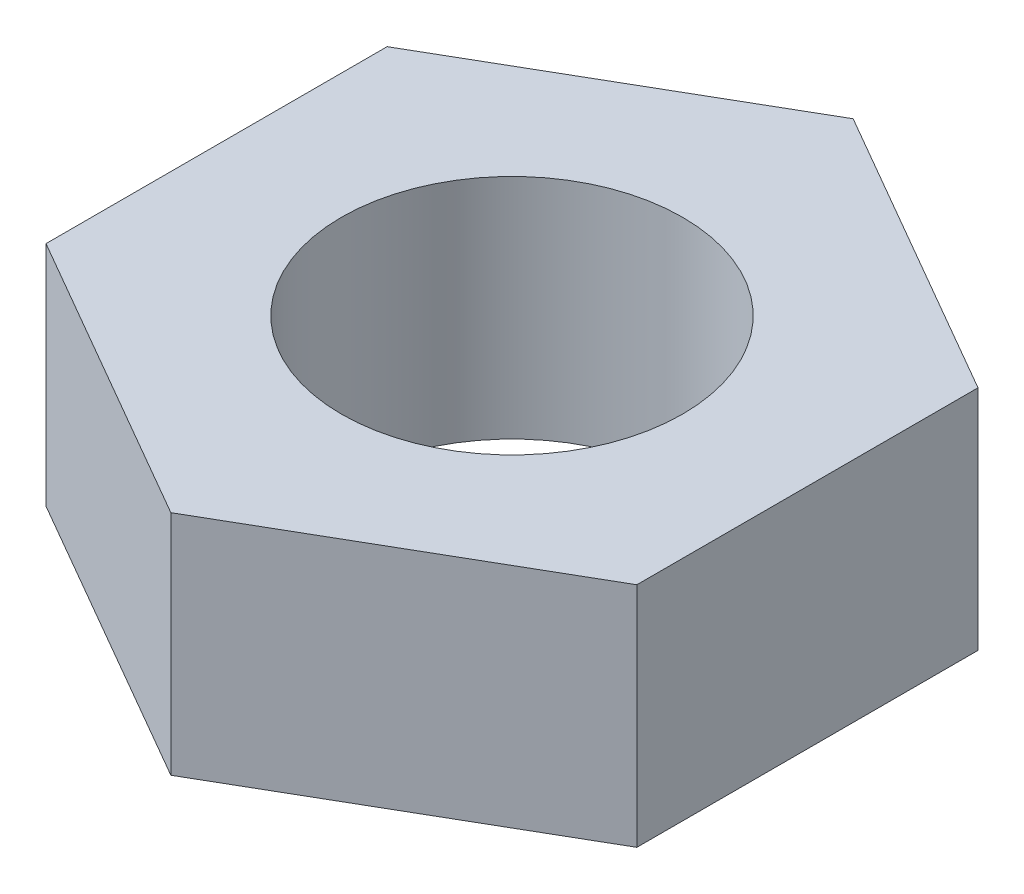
from build123d import *

# Parameters (mm, degrees)
SKETCH1_R      = 7.5
EXTRUDE1_DEPTH = 10


with BuildPart() as part:
    # Sketch1 → Extrude1 (new body)
    with BuildSketch(Plane(origin=(0, 0, 0), x_dir=(1, 0, 0), z_dir=(0, 1, 0))):
        Polygon((12.990381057, 7.5), (0, 15), (-12.990381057, 7.5), (-12.990381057, -7.5), (0, -15), (12.990381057, -7.5), align=None)
        with Locations(Location((0, 0, 0), (0, 0, 270))):
            Circle(SKETCH1_R, mode=Mode.SUBTRACT)
    extrude(amount=EXTRUDE1_DEPTH)


solid = part.part
